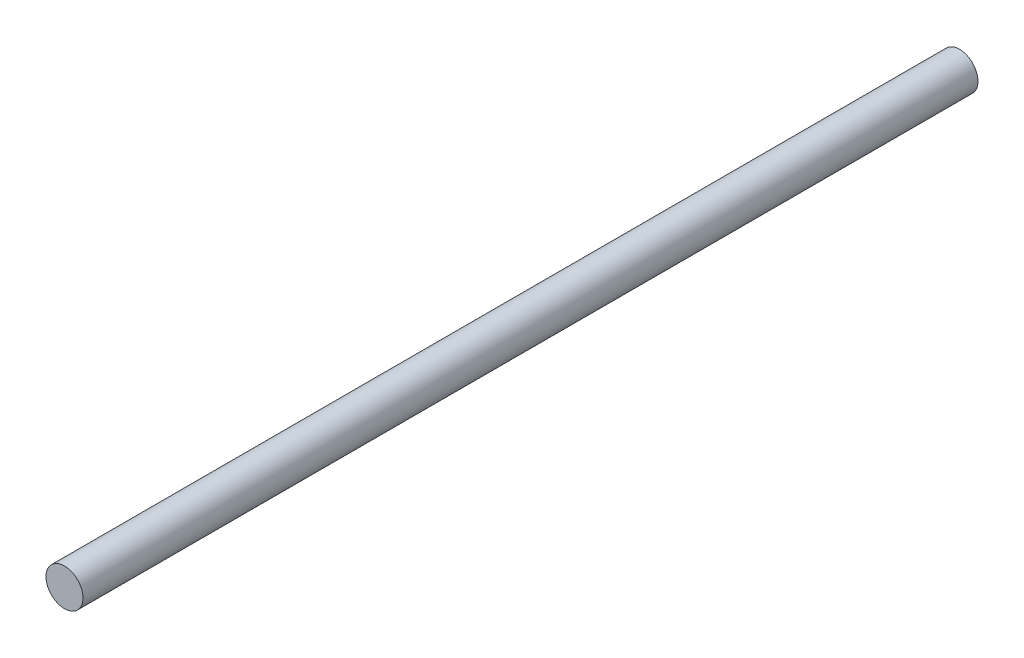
from build123d import *

# Parameters (mm, degrees)
SKETCH1_R           = 30
BOSS_EXTRUDE1_DEPTH = 1450


with BuildPart() as part:
    # Sketch1 → Boss-Extrude1 (new body)
    with BuildSketch(Plane.XY):
        Circle(SKETCH1_R)
    extrude(amount=-BOSS_EXTRUDE1_DEPTH)


solid = part.part
